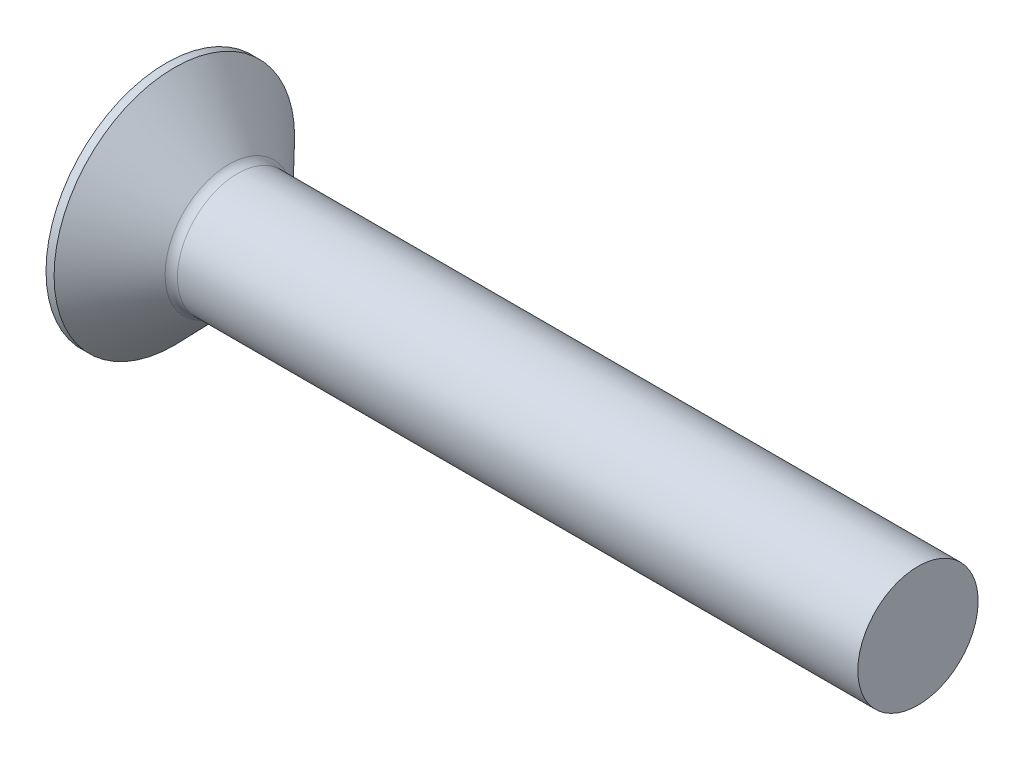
from build123d import *

# Parameters (mm, degrees)
FILLET1_R    = 0.8
RECPAT_COUNT = 2
RECPAT_ANGLE = 90


with BuildPart() as part:
    # BodySke → BaseBody (revolve)
    with BuildSketch(Plane.XY, mode=Mode.PRIVATE) as basebody_sk:
        with BuildLine():
            Line((1.8, 8), (2.337244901, 8))
            Line((2.337244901, 8), (6.2, 4))
            Line((6.2, 4), (51.8, 4))
            Line((51.8, 4), (51.8, 0))
            Line((51.8, 0), (1.8, 0))
            Line((1.8, 0), (0, 0))
            ThreePointArc((0, 0), (0.455555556, 4.1), (1.8, 8))
        make_face()
    revolve(basebody_sk.sketch.rotate(Axis((1.8, 0, 0), (1, 0, 0)), 90), axis=Axis((1.8, 0, 0), (1, 0, 0)))

    # Fillet1
    fillet1_edges = [part.edges().sort_by_distance(p)[0] for p in [
        (6.2, 0, -4),
    ]]
    fillet(fillet1_edges, radius=FILLET1_R)

    # RecSkeTop → Recess section 0
    with BuildSketch(Plane(origin=(0, 0, 0), x_dir=(0, 0, -1), z_dir=(1, 0, 0))):
        with BuildLine():
            Line((-0.946, 4.3), (0.946, 4.3))
            Line((0.946, 4.3), (0.946, -4.3))
            Line((0.946, -4.3), (-0.946, -4.3))
            Line((-0.946, -4.3), (-0.946, 4.3))
        make_face()
    # RecSkeBot → Recess section 1
    with BuildSketch(Plane(origin=(5.18, 0, 0), x_dir=(0, 0, -1), z_dir=(1, 0, 0))):
        with BuildLine():
            Line((-0.946, 1.717347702), (0.946, 1.717347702))
            Line((0.946, 1.717347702), (0.946, -1.717347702))
            Line((0.946, -1.717347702), (-0.946, -1.717347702))
            Line((-0.946, -1.717347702), (-0.946, 1.717347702))
        make_face()
    recess = loft(mode=Mode.SUBTRACT)

    # RecPat: Recess ×2 about axis
    recpat_axis = Axis((0, 0, 0), (1, 0, 0))
    for i in range(1, RECPAT_COUNT):
        add(recess.rotate(recpat_axis, i * RECPAT_ANGLE / (RECPAT_COUNT - 1)), mode=Mode.SUBTRACT)

    # RecCorSke → RecessCore (revolve, cut)
    with BuildSketch(Plane.XY, mode=Mode.PRIVATE) as recesscore_sk:
        Polygon((0, 0), (0, 2.0812), (5.18, 1.718979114), (5.738530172, 0), align=None)
    revolve(recesscore_sk.sketch.rotate(Axis((0, 0, 0), (1, 0, 0)), 90), axis=Axis((0, 0, 0), (1, 0, 0)), mode=Mode.SUBTRACT)


solid = part.part
